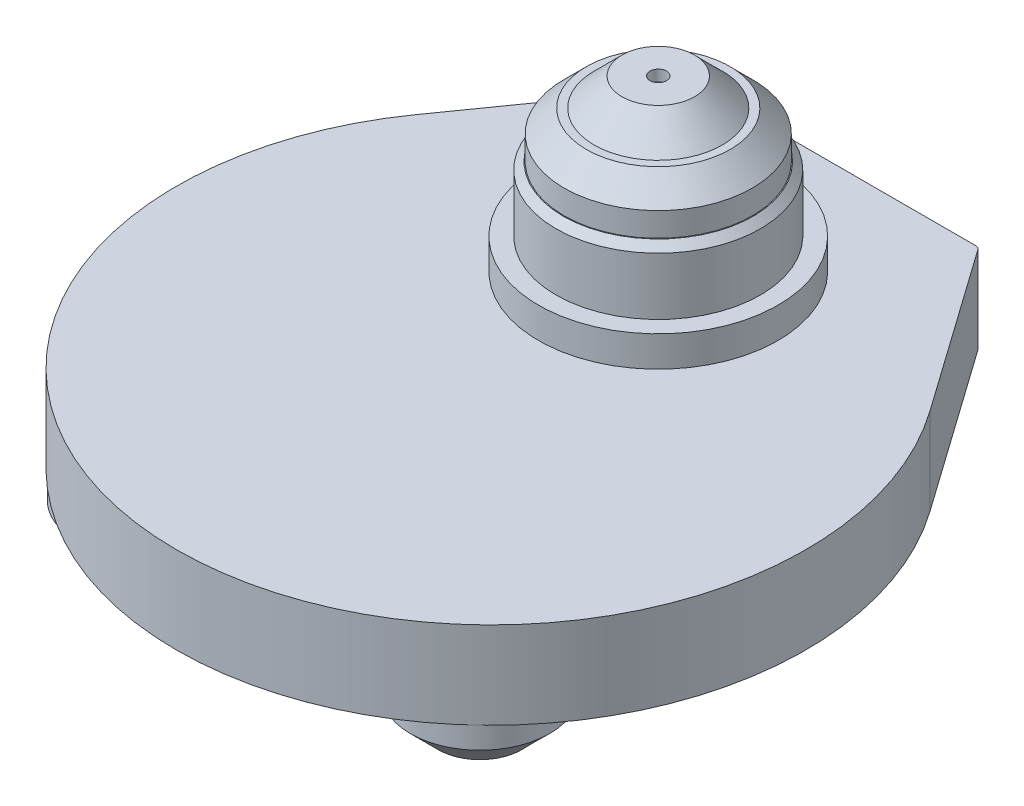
ISO-10303-21;
HEADER;
FILE_DESCRIPTION(('STEP AP214'),'2;1');
FILE_NAME('part.step','',(''),(''),'','','');
FILE_SCHEMA(('AUTOMOTIVE_DESIGN { 1 0 10303 214 1 1 1 1 }'));
ENDSEC;
DATA;
#1=APPLICATION_CONTEXT('core data for automotive mechanical design processes');
#2=APPLICATION_PROTOCOL_DEFINITION('international standard','automotive_design',2000,#1);
#3=PRODUCT_CONTEXT('',#1,'mechanical');
#4=PRODUCT('Part','Part','',(#3));
#5=PRODUCT_RELATED_PRODUCT_CATEGORY('part','',(#4));
#6=PRODUCT_DEFINITION_FORMATION('','',#4);
#7=PRODUCT_DEFINITION_CONTEXT('part definition',#1,'design');
#8=PRODUCT_DEFINITION('design','',#6,#7);
#9=PRODUCT_DEFINITION_SHAPE('','',#8);
#10=(LENGTH_UNIT() NAMED_UNIT(*) SI_UNIT(.MILLI.,.METRE.));
#11=(NAMED_UNIT(*) PLANE_ANGLE_UNIT() SI_UNIT($,.RADIAN.));
#12=(NAMED_UNIT(*) SI_UNIT($,.STERADIAN.) SOLID_ANGLE_UNIT());
#13=UNCERTAINTY_MEASURE_WITH_UNIT(LENGTH_MEASURE(1.E-05),#10,'distance_accuracy_value','');
#14=(GEOMETRIC_REPRESENTATION_CONTEXT(3) GLOBAL_UNCERTAINTY_ASSIGNED_CONTEXT((#13)) GLOBAL_UNIT_ASSIGNED_CONTEXT((#10,
#11,#12)) REPRESENTATION_CONTEXT('',''));
#15=CARTESIAN_POINT('',(0.,0.,0.));
#16=DIRECTION('',(0.,0.,1.));
#17=DIRECTION('',(1.,0.,0.));
#18=AXIS2_PLACEMENT_3D('',#15,#16,#17);
#19=CARTESIAN_POINT('',(0.,0.,30.));
#20=DIRECTION('',(0.,1.,0.));
#21=DIRECTION('',(0.,0.,1.));
#22=AXIS2_PLACEMENT_3D('',#19,#20,#21);
#23=PLANE('',#22);
#24=CARTESIAN_POINT('',(30.,0.,62.));
#25=DIRECTION('',(0.,1.,0.));
#26=DIRECTION('',(0.,0.,1.));
#27=AXIS2_PLACEMENT_3D('',#24,#25,#26);
#28=CIRCLE('',#27,12.5);
#29=CARTESIAN_POINT('',(30.,0.,74.5));
#30=VERTEX_POINT('',#29);
#31=EDGE_CURVE('E324',#30,#30,#28,.F.);
#32=ORIENTED_EDGE('',*,*,#31,.F.);
#33=EDGE_LOOP('',(#32));
#34=FACE_BOUND('',#33,.T.);
#35=DIRECTION('',(-1.,0.,0.));
#36=VECTOR('',#35,1.);
#37=CARTESIAN_POINT('',(-25.,0.,-32.5));
#38=LINE('',#37,#36);
#39=CARTESIAN_POINT('',(24.482417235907,0.,-32.5));
#40=VERTEX_POINT('',#39);
#41=CARTESIAN_POINT('',(-24.482417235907,0.,-32.5));
#42=VERTEX_POINT('',#41);
#43=EDGE_CURVE('E358',#40,#42,#38,.T.);
#44=ORIENTED_EDGE('',*,*,#43,.F.);
#45=CARTESIAN_POINT('',(24.482417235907,0.,-31.5));
#46=DIRECTION('',(0.,1.,0.));
#47=DIRECTION('',(0.,0.,1.));
#48=AXIS2_PLACEMENT_3D('',#45,#46,#47);
#49=CIRCLE('',#48,1.);
#50=CARTESIAN_POINT('',(25.2988634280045,0.,-32.077421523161));
#51=VERTEX_POINT('',#50);
#52=EDGE_CURVE('E476',#40,#51,#49,.F.);
#53=ORIENTED_EDGE('',*,*,#52,.T.);
#54=DIRECTION('',(-0.577421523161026,0.,-0.816446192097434));
#55=VECTOR('',#54,1.);
#56=CARTESIAN_POINT('',(25.,0.,-32.5));
#57=LINE('',#56,#55);
#58=CARTESIAN_POINT('',(46.129209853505,0.,-2.62431605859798));
#59=VERTEX_POINT('',#58);
#60=EDGE_CURVE('E362',#59,#51,#57,.T.);
#61=ORIENTED_EDGE('',*,*,#60,.F.);
#62=CARTESIAN_POINT('',(0.,0.,30.));
#63=DIRECTION('',(0.,1.,0.));
#64=DIRECTION('',(0.,0.,1.));
#65=AXIS2_PLACEMENT_3D('',#62,#63,#64);
#66=CIRCLE('',#65,56.5);
#67=CARTESIAN_POINT('',(-46.129209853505,0.,-2.62431605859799));
#68=VERTEX_POINT('',#67);
#69=EDGE_CURVE('E365',#68,#59,#66,.T.);
#70=ORIENTED_EDGE('',*,*,#69,.F.);
#71=DIRECTION('',(-0.577421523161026,0.,0.816446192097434));
#72=VECTOR('',#71,1.);
#73=CARTESIAN_POINT('',(-25.,0.,-32.5));
#74=LINE('',#73,#72);
#75=CARTESIAN_POINT('',(-25.2988634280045,0.,-32.077421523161));
#76=VERTEX_POINT('',#75);
#77=EDGE_CURVE('E367',#76,#68,#74,.T.);
#78=ORIENTED_EDGE('',*,*,#77,.F.);
#79=CARTESIAN_POINT('',(-24.482417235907,0.,-31.5));
#80=DIRECTION('',(0.,1.,0.));
#81=DIRECTION('',(0.,0.,1.));
#82=AXIS2_PLACEMENT_3D('',#79,#80,#81);
#83=CIRCLE('',#82,1.);
#84=EDGE_CURVE('E474',#76,#42,#83,.F.);
#85=ORIENTED_EDGE('',*,*,#84,.T.);
#86=EDGE_LOOP('',(#44,#53,#61,#70,#78,#85));
#87=FACE_BOUND('',#86,.T.);
#88=DIRECTION('',(0.,0.,1.));
#89=VECTOR('',#88,1.);
#90=CARTESIAN_POINT('',(8.,0.,-31.5));
#91=LINE('',#90,#89);
#92=CARTESIAN_POINT('',(8.,0.,-30.5));
#93=VERTEX_POINT('',#92);
#94=CARTESIAN_POINT('',(8.,0.,-24.0018749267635));
#95=VERTEX_POINT('',#94);
#96=EDGE_CURVE('E400',#93,#95,#91,.T.);
#97=ORIENTED_EDGE('',*,*,#96,.F.);
#98=CARTESIAN_POINT('',(7.,0.,-30.5));
#99=DIRECTION('',(0.,1.,0.));
#100=DIRECTION('',(0.,0.,1.));
#101=AXIS2_PLACEMENT_3D('',#98,#99,#100);
#102=CIRCLE('',#101,1.);
#103=CARTESIAN_POINT('',(7.,0.,-31.5));
#104=VERTEX_POINT('',#103);
#105=EDGE_CURVE('E45',#93,#104,#102,.T.);
#106=ORIENTED_EDGE('',*,*,#105,.T.);
#107=DIRECTION('',(1.,0.,0.));
#108=VECTOR('',#107,1.);
#109=CARTESIAN_POINT('',(0.,0.,-31.5));
#110=LINE('',#109,#108);
#111=CARTESIAN_POINT('',(-7.,0.,-31.5));
#112=VERTEX_POINT('',#111);
#113=EDGE_CURVE('E402',#112,#104,#110,.T.);
#114=ORIENTED_EDGE('',*,*,#113,.F.);
#115=CARTESIAN_POINT('',(-7.,0.,-30.5));
#116=DIRECTION('',(0.,1.,0.));
#117=DIRECTION('',(0.,0.,1.));
#118=AXIS2_PLACEMENT_3D('',#115,#116,#117);
#119=CIRCLE('',#118,1.);
#120=CARTESIAN_POINT('',(-8.,0.,-30.5));
#121=VERTEX_POINT('',#120);
#122=EDGE_CURVE('E13',#112,#121,#119,.T.);
#123=ORIENTED_EDGE('',*,*,#122,.T.);
#124=DIRECTION('',(0.,0.,-1.));
#125=VECTOR('',#124,1.);
#126=CARTESIAN_POINT('',(-8.,0.,-31.5));
#127=LINE('',#126,#125);
#128=CARTESIAN_POINT('',(-8.,0.,-24.0018749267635));
#129=VERTEX_POINT('',#128);
#130=EDGE_CURVE('E397',#129,#121,#127,.T.);
#131=ORIENTED_EDGE('',*,*,#130,.F.);
#132=CARTESIAN_POINT('',(0.,0.,0.));
#133=DIRECTION('',(0.,1.,0.));
#134=DIRECTION('',(0.,0.,1.));
#135=AXIS2_PLACEMENT_3D('',#132,#133,#134);
#136=CIRCLE('',#135,25.3);
#137=EDGE_CURVE('E325',#95,#129,#136,.F.);
#138=ORIENTED_EDGE('',*,*,#137,.F.);
#139=EDGE_LOOP('',(#97,#106,#114,#123,#131,#138));
#140=FACE_BOUND('',#139,.T.);
#141=CARTESIAN_POINT('',(-30.,0.,62.));
#142=DIRECTION('',(0.,1.,0.));
#143=DIRECTION('',(0.,0.,1.));
#144=AXIS2_PLACEMENT_3D('',#141,#142,#143);
#145=CIRCLE('',#144,12.5);
#146=CARTESIAN_POINT('',(-30.,0.,74.5));
#147=VERTEX_POINT('',#146);
#148=EDGE_CURVE('E316',#147,#147,#145,.F.);
#149=ORIENTED_EDGE('',*,*,#148,.F.);
#150=EDGE_LOOP('',(#149));
#151=FACE_BOUND('',#150,.T.);
#152=ADVANCED_FACE('F37',(#34,#87,#140,#151),#23,.F.);
#153=CARTESIAN_POINT('',(0.,-8.9,0.));
#154=DIRECTION('',(0.,-1.,0.));
#155=DIRECTION('',(0.,0.,-1.));
#156=AXIS2_PLACEMENT_3D('',#153,#154,#155);
#157=PLANE('',#156);
#158=CARTESIAN_POINT('',(0.,-8.9,0.));
#159=DIRECTION('',(0.,-1.,0.));
#160=DIRECTION('',(0.,0.,-1.));
#161=AXIS2_PLACEMENT_3D('',#158,#159,#160);
#162=CIRCLE('',#161,25.3);
#163=CARTESIAN_POINT('',(0.,-8.9,-25.3));
#164=VERTEX_POINT('',#163);
#165=EDGE_CURVE('E387',#164,#164,#162,.T.);
#166=ORIENTED_EDGE('',*,*,#165,.T.);
#167=EDGE_LOOP('',(#166));
#168=FACE_BOUND('',#167,.T.);
#169=CARTESIAN_POINT('',(0.,-8.9,0.));
#170=DIRECTION('',(0.,-1.,0.));
#171=DIRECTION('',(0.,0.,-1.));
#172=AXIS2_PLACEMENT_3D('',#169,#170,#171);
#173=CIRCLE('',#172,18.1175227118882);
#174=CARTESIAN_POINT('',(0.,-8.9,-18.1175227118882));
#175=VERTEX_POINT('',#174);
#176=EDGE_CURVE('E404',#175,#175,#173,.T.);
#177=ORIENTED_EDGE('',*,*,#176,.F.);
#178=EDGE_LOOP('',(#177));
#179=FACE_BOUND('',#178,.T.);
#180=ADVANCED_FACE('F235',(#168,#179),#157,.T.);
#181=CARTESIAN_POINT('',(0.,-8.9,0.));
#182=DIRECTION('',(0.,1.,0.));
#183=DIRECTION('',(0.,0.,1.));
#184=AXIS2_PLACEMENT_3D('',#181,#182,#183);
#185=CYLINDRICAL_SURFACE('',#184,25.3);
#186=ORIENTED_EDGE('',*,*,#165,.F.);
#187=EDGE_LOOP('',(#186));
#188=FACE_BOUND('',#187,.T.);
#189=DIRECTION('',(0.,1.,0.));
#190=VECTOR('',#189,1.);
#191=CARTESIAN_POINT('',(8.,-8.7,-24.0018749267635));
#192=LINE('',#191,#190);
#193=CARTESIAN_POINT('',(8.,-8.7,-24.0018749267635));
#194=VERTEX_POINT('',#193);
#195=EDGE_CURVE('E390',#194,#95,#192,.T.);
#196=ORIENTED_EDGE('',*,*,#195,.T.);
#197=ORIENTED_EDGE('',*,*,#137,.T.);
#198=DIRECTION('',(0.,1.,0.));
#199=VECTOR('',#198,1.);
#200=CARTESIAN_POINT('',(-7.99999999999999,-8.7,-24.0018749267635));
#201=LINE('',#200,#199);
#202=CARTESIAN_POINT('',(-7.99999999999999,-8.7,-24.0018749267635));
#203=VERTEX_POINT('',#202);
#204=EDGE_CURVE('E393',#203,#129,#201,.T.);
#205=ORIENTED_EDGE('',*,*,#204,.F.);
#206=CARTESIAN_POINT('',(0.,-8.7,0.));
#207=DIRECTION('',(0.,1.,0.));
#208=DIRECTION('',(0.,0.,1.));
#209=AXIS2_PLACEMENT_3D('',#206,#207,#208);
#210=CIRCLE('',#209,25.3);
#211=EDGE_CURVE('E406',#194,#203,#210,.T.);
#212=ORIENTED_EDGE('',*,*,#211,.F.);
#213=EDGE_LOOP('',(#196,#197,#205,#212));
#214=FACE_BOUND('',#213,.T.);
#215=ADVANCED_FACE('F238',(#188,#214),#185,.T.);
#216=CARTESIAN_POINT('',(0.,32.7,0.));
#217=DIRECTION('',(0.,1.,0.));
#218=DIRECTION('',(0.,0.,1.));
#219=AXIS2_PLACEMENT_3D('',#216,#217,#218);
#220=CYLINDRICAL_SURFACE('',#219,16.9);
#221=CARTESIAN_POINT('',(0.,37.,0.));
#222=DIRECTION('',(0.,1.,0.));
#223=DIRECTION('',(0.,0.,1.));
#224=AXIS2_PLACEMENT_3D('',#221,#222,#223);
#225=CIRCLE('',#224,16.9);
#226=CARTESIAN_POINT('',(0.,37.,16.9));
#227=VERTEX_POINT('',#226);
#228=EDGE_CURVE('E337',#227,#227,#225,.F.);
#229=ORIENTED_EDGE('',*,*,#228,.T.);
#230=EDGE_LOOP('',(#229));
#231=FACE_BOUND('',#230,.T.);
#232=CARTESIAN_POINT('',(0.,32.7,0.));
#233=DIRECTION('',(0.,1.,0.));
#234=DIRECTION('',(0.,0.,1.));
#235=AXIS2_PLACEMENT_3D('',#232,#233,#234);
#236=CIRCLE('',#235,16.9);
#237=CARTESIAN_POINT('',(0.,32.7,16.9));
#238=VERTEX_POINT('',#237);
#239=EDGE_CURVE('E381',#238,#238,#236,.T.);
#240=ORIENTED_EDGE('',*,*,#239,.T.);
#241=EDGE_LOOP('',(#240));
#242=FACE_BOUND('',#241,.T.);
#243=ADVANCED_FACE('F242',(#231,#242),#220,.T.);
#244=CARTESIAN_POINT('',(0.,21.1,0.));
#245=DIRECTION('',(0.,1.,0.));
#246=DIRECTION('',(0.,0.,1.));
#247=AXIS2_PLACEMENT_3D('',#244,#245,#246);
#248=CYLINDRICAL_SURFACE('',#247,18.35);
#249=CARTESIAN_POINT('',(0.,31.4,0.));
#250=DIRECTION('',(0.,1.,0.));
#251=DIRECTION('',(0.,0.,1.));
#252=AXIS2_PLACEMENT_3D('',#249,#250,#251);
#253=CIRCLE('',#252,18.35);
#254=CARTESIAN_POINT('',(0.,31.4,18.35));
#255=VERTEX_POINT('',#254);
#256=EDGE_CURVE('E343',#255,#255,#253,.F.);
#257=ORIENTED_EDGE('',*,*,#256,.T.);
#258=EDGE_LOOP('',(#257));
#259=FACE_BOUND('',#258,.T.);
#260=CARTESIAN_POINT('',(0.,21.1,0.));
#261=DIRECTION('',(0.,1.,0.));
#262=DIRECTION('',(0.,0.,1.));
#263=AXIS2_PLACEMENT_3D('',#260,#261,#262);
#264=CIRCLE('',#263,18.35);
#265=CARTESIAN_POINT('',(0.,21.1,18.35));
#266=VERTEX_POINT('',#265);
#267=EDGE_CURVE('E351',#266,#266,#264,.T.);
#268=ORIENTED_EDGE('',*,*,#267,.T.);
#269=EDGE_LOOP('',(#268));
#270=FACE_BOUND('',#269,.T.);
#271=ADVANCED_FACE('F252',(#259,#270),#248,.T.);
#272=CARTESIAN_POINT('',(0.,46.,0.));
#273=DIRECTION('',(0.,-1.,0.));
#274=DIRECTION('',(0.,0.,-1.));
#275=AXIS2_PLACEMENT_3D('',#272,#273,#274);
#276=CYLINDRICAL_SURFACE('',#275,21.5);
#277=CARTESIAN_POINT('',(0.,15.6,0.));
#278=DIRECTION('',(0.,1.,0.));
#279=DIRECTION('',(0.,0.,1.));
#280=AXIS2_PLACEMENT_3D('',#277,#278,#279);
#281=CIRCLE('',#280,21.5);
#282=CARTESIAN_POINT('',(0.,15.6,-21.5));
#283=VERTEX_POINT('',#282);
#284=EDGE_CURVE('E350',#283,#283,#281,.T.);
#285=CARTESIAN_POINT('',(0.,21.1,0.));
#286=DIRECTION('',(0.,1.,0.));
#287=DIRECTION('',(0.,0.,1.));
#288=AXIS2_PLACEMENT_3D('',#285,#286,#287);
#289=CIRCLE('',#288,21.5);
#290=CARTESIAN_POINT('',(0.,21.1,-21.5));
#291=VERTEX_POINT('',#290);
#292=EDGE_CURVE('E347',#291,#291,#289,.T.);
#293=CARTESIAN_POINT('',(0.,15.6,-21.5));
#294=CARTESIAN_POINT('',(0.,15.6572916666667,-21.5));
#295=CARTESIAN_POINT('',(0.,15.7145833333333,-21.5));
#296=CARTESIAN_POINT('',(0.,15.8291666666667,-21.5));
#297=CARTESIAN_POINT('',(0.,15.8864583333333,-21.5));
#298=CARTESIAN_POINT('',(0.,16.0010416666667,-21.5));
#299=CARTESIAN_POINT('',(0.,16.0583333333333,-21.5));
#300=CARTESIAN_POINT('',(0.,16.1729166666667,-21.5));
#301=CARTESIAN_POINT('',(0.,16.2302083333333,-21.5));
#302=CARTESIAN_POINT('',(0.,16.3447916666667,-21.5));
#303=CARTESIAN_POINT('',(0.,16.4020833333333,-21.5));
#304=CARTESIAN_POINT('',(0.,16.5166666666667,-21.5));
#305=CARTESIAN_POINT('',(0.,16.5739583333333,-21.5));
#306=CARTESIAN_POINT('',(0.,16.6885416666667,-21.5));
#307=CARTESIAN_POINT('',(0.,16.7458333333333,-21.5));
#308=CARTESIAN_POINT('',(0.,16.8604166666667,-21.5));
#309=CARTESIAN_POINT('',(0.,16.9177083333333,-21.5));
#310=CARTESIAN_POINT('',(0.,17.0322916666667,-21.5));
#311=CARTESIAN_POINT('',(0.,17.0895833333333,-21.5));
#312=CARTESIAN_POINT('',(0.,17.2041666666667,-21.5));
#313=CARTESIAN_POINT('',(0.,17.2614583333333,-21.5));
#314=CARTESIAN_POINT('',(0.,17.3760416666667,-21.5));
#315=CARTESIAN_POINT('',(0.,17.4333333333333,-21.5));
#316=CARTESIAN_POINT('',(0.,17.5479166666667,-21.5));
#317=CARTESIAN_POINT('',(0.,17.6052083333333,-21.5));
#318=CARTESIAN_POINT('',(0.,17.7197916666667,-21.5));
#319=CARTESIAN_POINT('',(0.,17.7770833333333,-21.5));
#320=CARTESIAN_POINT('',(0.,17.8916666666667,-21.5));
#321=CARTESIAN_POINT('',(0.,17.9489583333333,-21.5));
#322=CARTESIAN_POINT('',(0.,18.0635416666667,-21.5));
#323=CARTESIAN_POINT('',(0.,18.1208333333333,-21.5));
#324=CARTESIAN_POINT('',(0.,18.2354166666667,-21.5));
#325=CARTESIAN_POINT('',(0.,18.2927083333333,-21.5));
#326=CARTESIAN_POINT('',(0.,18.4072916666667,-21.5));
#327=CARTESIAN_POINT('',(0.,18.4645833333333,-21.5));
#328=CARTESIAN_POINT('',(0.,18.5791666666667,-21.5));
#329=CARTESIAN_POINT('',(0.,18.6364583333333,-21.5));
#330=CARTESIAN_POINT('',(0.,18.7510416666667,-21.5));
#331=CARTESIAN_POINT('',(0.,18.8083333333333,-21.5));
#332=CARTESIAN_POINT('',(0.,18.9229166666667,-21.5));
#333=CARTESIAN_POINT('',(0.,18.9802083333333,-21.5));
#334=CARTESIAN_POINT('',(0.,19.0947916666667,-21.5));
#335=CARTESIAN_POINT('',(0.,19.1520833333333,-21.5));
#336=CARTESIAN_POINT('',(0.,19.2666666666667,-21.5));
#337=CARTESIAN_POINT('',(0.,19.3239583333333,-21.5));
#338=CARTESIAN_POINT('',(0.,19.4385416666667,-21.5));
#339=CARTESIAN_POINT('',(0.,19.4958333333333,-21.5));
#340=CARTESIAN_POINT('',(0.,19.6104166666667,-21.5));
#341=CARTESIAN_POINT('',(0.,19.6677083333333,-21.5));
#342=CARTESIAN_POINT('',(0.,19.7822916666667,-21.5));
#343=CARTESIAN_POINT('',(0.,19.8395833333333,-21.5));
#344=CARTESIAN_POINT('',(0.,19.9541666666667,-21.5));
#345=CARTESIAN_POINT('',(0.,20.0114583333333,-21.5));
#346=CARTESIAN_POINT('',(0.,20.1260416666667,-21.5));
#347=CARTESIAN_POINT('',(0.,20.1833333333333,-21.5));
#348=CARTESIAN_POINT('',(0.,20.2979166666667,-21.5));
#349=CARTESIAN_POINT('',(0.,20.3552083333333,-21.5));
#350=CARTESIAN_POINT('',(0.,20.4697916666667,-21.5));
#351=CARTESIAN_POINT('',(0.,20.5270833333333,-21.5));
#352=CARTESIAN_POINT('',(0.,20.6416666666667,-21.5));
#353=CARTESIAN_POINT('',(0.,20.6989583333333,-21.5));
#354=CARTESIAN_POINT('',(0.,20.8135416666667,-21.5));
#355=CARTESIAN_POINT('',(0.,20.8708333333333,-21.5));
#356=CARTESIAN_POINT('',(0.,20.9854166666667,-21.5));
#357=CARTESIAN_POINT('',(0.,21.0427083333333,-21.5));
#358=CARTESIAN_POINT('',(0.,21.1,-21.5));
#359=B_SPLINE_CURVE_WITH_KNOTS('',3,(#293,#294,#295,#296,#297,#298,#299,#300,#301,#302,#303,
#304,#305,#306,#307,#308,#309,#310,#311,#312,#313,#314,#315,#316,#317,#318,#319,#320,#321,#322,
#323,#324,#325,#326,#327,#328,#329,#330,#331,#332,#333,#334,#335,#336,#337,#338,#339,#340,#341,
#342,#343,#344,#345,#346,#347,#348,#349,#350,#351,#352,#353,#354,#355,#356,#357,#358),
.UNSPECIFIED.,.F.,.F.,(4,2,2,2,2,2,2,2,2,2,2,2,2,2,2,2,2,2,2,2,2,2,2,2,2,2,2,2,2,2,2,2,4),(0.,
0.171874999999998,0.34375,0.515624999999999,0.687500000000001,0.859374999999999,1.03125,
1.203125,1.375,1.546875,1.71875,1.890625,2.0625,2.234375,2.40625,2.578125,2.75,2.921875,3.09375,
3.265625,3.4375,3.609375,3.78125,3.953125,4.125,4.296875,4.46875,4.640625,4.8125,4.984375,
5.15625,5.328125,5.5),.UNSPECIFIED.);
#360=EDGE_CURVE('BSEAM260',#283,#291,#359,.T.);
#361=ORIENTED_EDGE('',*,*,#284,.T.);
#362=ORIENTED_EDGE('',*,*,#292,.F.);
#363=ORIENTED_EDGE('',*,*,#360,.T.);
#364=ORIENTED_EDGE('',*,*,#360,.F.);
#365=EDGE_LOOP('',(#361,#363,#362,#364));
#366=FACE_BOUND('',#365,.T.);
#367=ADVANCED_FACE('F260',(#366),#276,.T.);
#368=CARTESIAN_POINT('',(0.,15.6,30.));
#369=DIRECTION('',(0.,1.,0.));
#370=DIRECTION('',(0.,0.,1.));
#371=AXIS2_PLACEMENT_3D('',#368,#369,#370);
#372=PLANE('',#371);
#373=DIRECTION('',(-0.577421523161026,0.,-0.816446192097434));
#374=VECTOR('',#373,1.);
#375=CARTESIAN_POINT('',(25.,15.6,-32.5));
#376=LINE('',#375,#374);
#377=CARTESIAN_POINT('',(46.129209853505,15.6,-2.62431605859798));
#378=VERTEX_POINT('',#377);
#379=CARTESIAN_POINT('',(25.2988634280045,15.6,-32.077421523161));
#380=VERTEX_POINT('',#379);
#381=EDGE_CURVE('E371',#378,#380,#376,.T.);
#382=ORIENTED_EDGE('',*,*,#381,.T.);
#383=CARTESIAN_POINT('',(24.482417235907,15.6,-31.5));
#384=DIRECTION('',(0.,1.,0.));
#385=DIRECTION('',(0.,0.,1.));
#386=AXIS2_PLACEMENT_3D('',#383,#384,#385);
#387=CIRCLE('',#386,1.);
#388=CARTESIAN_POINT('',(24.482417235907,15.6,-32.5));
#389=VERTEX_POINT('',#388);
#390=EDGE_CURVE('E482',#380,#389,#387,.T.);
#391=ORIENTED_EDGE('',*,*,#390,.T.);
#392=DIRECTION('',(-1.,0.,0.));
#393=VECTOR('',#392,1.);
#394=CARTESIAN_POINT('',(0.,15.6,-32.5));
#395=LINE('',#394,#393);
#396=CARTESIAN_POINT('',(-24.482417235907,15.6,-32.5));
#397=VERTEX_POINT('',#396);
#398=EDGE_CURVE('E357',#389,#397,#395,.T.);
#399=ORIENTED_EDGE('',*,*,#398,.T.);
#400=CARTESIAN_POINT('',(-24.482417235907,15.6,-31.5));
#401=DIRECTION('',(0.,1.,0.));
#402=DIRECTION('',(0.,0.,1.));
#403=AXIS2_PLACEMENT_3D('',#400,#401,#402);
#404=CIRCLE('',#403,1.);
#405=CARTESIAN_POINT('',(-25.2988634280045,15.6,-32.077421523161));
#406=VERTEX_POINT('',#405);
#407=EDGE_CURVE('E480',#397,#406,#404,.T.);
#408=ORIENTED_EDGE('',*,*,#407,.T.);
#409=DIRECTION('',(-0.577421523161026,0.,0.816446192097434));
#410=VECTOR('',#409,1.);
#411=CARTESIAN_POINT('',(-25.,15.6,-32.5));
#412=LINE('',#411,#410);
#413=CARTESIAN_POINT('',(-46.129209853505,15.6,-2.62431605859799));
#414=VERTEX_POINT('',#413);
#415=EDGE_CURVE('E361',#406,#414,#412,.T.);
#416=ORIENTED_EDGE('',*,*,#415,.T.);
#417=CARTESIAN_POINT('',(0.,15.6,30.));
#418=DIRECTION('',(0.,1.,0.));
#419=DIRECTION('',(0.,0.,1.));
#420=AXIS2_PLACEMENT_3D('',#417,#418,#419);
#421=CIRCLE('',#420,56.5);
#422=EDGE_CURVE('E374',#414,#378,#421,.T.);
#423=ORIENTED_EDGE('',*,*,#422,.T.);
#424=EDGE_LOOP('',(#382,#391,#399,#408,#416,#423));
#425=FACE_BOUND('',#424,.T.);
#426=ORIENTED_EDGE('',*,*,#284,.F.);
#427=EDGE_LOOP('',(#426));
#428=FACE_BOUND('',#427,.T.);
#429=ADVANCED_FACE('F272',(#425,#428),#372,.T.);
#430=CARTESIAN_POINT('',(-25.,15.6,-32.5));
#431=DIRECTION('',(0.816446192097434,0.,0.577421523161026));
#432=DIRECTION('',(0.577421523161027,0.,-0.816446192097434));
#433=AXIS2_PLACEMENT_3D('',#430,#431,#432);
#434=PLANE('',#433);
#435=ORIENTED_EDGE('',*,*,#415,.F.);
#436=DIRECTION('',(0.,-1.,0.));
#437=VECTOR('',#436,1.);
#438=CARTESIAN_POINT('',(-25.2988634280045,15.6,-32.077421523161));
#439=LINE('',#438,#437);
#440=EDGE_CURVE('E496',#406,#76,#439,.T.);
#441=ORIENTED_EDGE('',*,*,#440,.T.);
#442=ORIENTED_EDGE('',*,*,#77,.T.);
#443=DIRECTION('',(0.,-1.,0.));
#444=VECTOR('',#443,1.);
#445=CARTESIAN_POINT('',(-46.129209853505,15.6,-2.62431605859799));
#446=LINE('',#445,#444);
#447=EDGE_CURVE('E346',#414,#68,#446,.T.);
#448=ORIENTED_EDGE('',*,*,#447,.F.);
#449=EDGE_LOOP('',(#435,#441,#442,#448));
#450=FACE_BOUND('',#449,.T.);
#451=ADVANCED_FACE('F276',(#450),#434,.F.);
#452=CARTESIAN_POINT('',(0.,15.6,30.));
#453=DIRECTION('',(0.,-1.,0.));
#454=DIRECTION('',(0.,0.,-1.));
#455=AXIS2_PLACEMENT_3D('',#452,#453,#454);
#456=CYLINDRICAL_SURFACE('',#455,56.5);
#457=ORIENTED_EDGE('',*,*,#69,.T.);
#458=DIRECTION('',(0.,-1.,0.));
#459=VECTOR('',#458,1.);
#460=CARTESIAN_POINT('',(46.129209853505,15.6,-2.62431605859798));
#461=LINE('',#460,#459);
#462=EDGE_CURVE('E354',#378,#59,#461,.T.);
#463=ORIENTED_EDGE('',*,*,#462,.F.);
#464=ORIENTED_EDGE('',*,*,#422,.F.);
#465=ORIENTED_EDGE('',*,*,#447,.T.);
#466=EDGE_LOOP('',(#457,#463,#464,#465));
#467=FACE_BOUND('',#466,.T.);
#468=ADVANCED_FACE('F287',(#467),#456,.T.);
#469=CARTESIAN_POINT('',(25.,15.6,-32.5));
#470=DIRECTION('',(-0.816446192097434,0.,0.577421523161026));
#471=DIRECTION('',(0.577421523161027,0.,0.816446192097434));
#472=AXIS2_PLACEMENT_3D('',#469,#470,#471);
#473=PLANE('',#472);
#474=ORIENTED_EDGE('',*,*,#60,.T.);
#475=DIRECTION('',(0.,-1.,0.));
#476=VECTOR('',#475,1.);
#477=CARTESIAN_POINT('',(25.2988634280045,15.6,-32.077421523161));
#478=LINE('',#477,#476);
#479=EDGE_CURVE('E478',#51,#380,#478,.F.);
#480=ORIENTED_EDGE('',*,*,#479,.T.);
#481=ORIENTED_EDGE('',*,*,#381,.F.);
#482=ORIENTED_EDGE('',*,*,#462,.T.);
#483=EDGE_LOOP('',(#474,#480,#481,#482));
#484=FACE_BOUND('',#483,.T.);
#485=ADVANCED_FACE('F283',(#484),#473,.F.);
#486=CARTESIAN_POINT('',(-25.,15.6,-32.5));
#487=DIRECTION('',(0.,0.,1.));
#488=DIRECTION('',(1.,0.,0.));
#489=AXIS2_PLACEMENT_3D('',#486,#487,#488);
#490=PLANE('',#489);
#491=ORIENTED_EDGE('',*,*,#398,.F.);
#492=DIRECTION('',(0.,-1.,0.));
#493=VECTOR('',#492,1.);
#494=CARTESIAN_POINT('',(24.482417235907,15.6,-32.5));
#495=LINE('',#494,#493);
#496=EDGE_CURVE('E471',#389,#40,#495,.T.);
#497=ORIENTED_EDGE('',*,*,#496,.T.);
#498=ORIENTED_EDGE('',*,*,#43,.T.);
#499=DIRECTION('',(0.,-1.,0.));
#500=VECTOR('',#499,1.);
#501=CARTESIAN_POINT('',(-24.482417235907,15.6,-32.5));
#502=LINE('',#501,#500);
#503=EDGE_CURVE('E469',#42,#397,#502,.F.);
#504=ORIENTED_EDGE('',*,*,#503,.T.);
#505=EDGE_LOOP('',(#491,#497,#498,#504));
#506=FACE_BOUND('',#505,.T.);
#507=ADVANCED_FACE('F264',(#506),#490,.F.);
#508=CARTESIAN_POINT('',(0.,21.1,27.));
#509=DIRECTION('',(0.,1.,0.));
#510=DIRECTION('',(0.,0.,1.));
#511=AXIS2_PLACEMENT_3D('',#508,#509,#510);
#512=PLANE('',#511);
#513=ORIENTED_EDGE('',*,*,#267,.F.);
#514=EDGE_LOOP('',(#513));
#515=FACE_BOUND('',#514,.T.);
#516=ORIENTED_EDGE('',*,*,#292,.T.);
#517=EDGE_LOOP('',(#516));
#518=FACE_BOUND('',#517,.T.);
#519=ADVANCED_FACE('F256',(#515,#518),#512,.T.);
#520=CARTESIAN_POINT('',(0.,32.7,27.));
#521=DIRECTION('',(0.,1.,0.));
#522=DIRECTION('',(0.,0.,1.));
#523=AXIS2_PLACEMENT_3D('',#520,#521,#522);
#524=PLANE('',#523);
#525=CARTESIAN_POINT('',(0.,32.7,0.));
#526=DIRECTION('',(0.,1.,0.));
#527=DIRECTION('',(0.,0.,1.));
#528=AXIS2_PLACEMENT_3D('',#525,#526,#527);
#529=CIRCLE('',#528,17.05);
#530=CARTESIAN_POINT('',(0.,32.7,17.05));
#531=VERTEX_POINT('',#530);
#532=EDGE_CURVE('E340',#531,#531,#529,.T.);
#533=ORIENTED_EDGE('',*,*,#532,.T.);
#534=EDGE_LOOP('',(#533));
#535=FACE_BOUND('',#534,.T.);
#536=ORIENTED_EDGE('',*,*,#239,.F.);
#537=EDGE_LOOP('',(#536));
#538=FACE_BOUND('',#537,.T.);
#539=ADVANCED_FACE('F248',(#535,#538),#524,.T.);
#540=CARTESIAN_POINT('',(0.,41.,27.));
#541=DIRECTION('',(0.,1.,0.));
#542=DIRECTION('',(0.,0.,1.));
#543=AXIS2_PLACEMENT_3D('',#540,#541,#542);
#544=PLANE('',#543);
#545=CARTESIAN_POINT('',(0.,41.,0.));
#546=DIRECTION('',(0.,1.,0.));
#547=DIRECTION('',(0.,0.,1.));
#548=AXIS2_PLACEMENT_3D('',#545,#546,#547);
#549=CIRCLE('',#548,12.9);
#550=CARTESIAN_POINT('',(0.,41.,12.9));
#551=VERTEX_POINT('',#550);
#552=EDGE_CURVE('E334',#551,#551,#549,.T.);
#553=ORIENTED_EDGE('',*,*,#552,.T.);
#554=EDGE_LOOP('',(#553));
#555=FACE_BOUND('',#554,.T.);
#556=CARTESIAN_POINT('',(0.,41.,0.));
#557=DIRECTION('',(0.,1.,0.));
#558=DIRECTION('',(0.,0.,1.));
#559=AXIS2_PLACEMENT_3D('',#556,#557,#558);
#560=CIRCLE('',#559,11.5);
#561=CARTESIAN_POINT('',(0.,41.,11.5));
#562=VERTEX_POINT('',#561);
#563=EDGE_CURVE('E384',#562,#562,#560,.T.);
#564=ORIENTED_EDGE('',*,*,#563,.F.);
#565=EDGE_LOOP('',(#564));
#566=FACE_BOUND('',#565,.T.);
#567=ADVANCED_FACE('F244',(#555,#566),#544,.T.);
#568=CARTESIAN_POINT('',(0.,46.,0.));
#569=DIRECTION('',(0.,1.,0.));
#570=DIRECTION('',(0.,0.,1.));
#571=AXIS2_PLACEMENT_3D('',#568,#569,#570);
#572=PLANE('',#571);
#573=CARTESIAN_POINT('',(0.,46.,0.));
#574=DIRECTION('',(0.,1.,0.));
#575=DIRECTION('',(0.,0.,1.));
#576=AXIS2_PLACEMENT_3D('',#573,#574,#575);
#577=CIRCLE('',#576,1.49223204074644);
#578=CARTESIAN_POINT('',(0.,46.,1.49223204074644));
#579=VERTEX_POINT('',#578);
#580=EDGE_CURVE('E422',#579,#579,#577,.T.);
#581=ORIENTED_EDGE('',*,*,#580,.F.);
#582=EDGE_LOOP('',(#581));
#583=FACE_BOUND('',#582,.T.);
#584=CARTESIAN_POINT('',(0.,46.,0.));
#585=DIRECTION('',(0.,1.,0.));
#586=DIRECTION('',(0.,0.,1.));
#587=AXIS2_PLACEMENT_3D('',#584,#585,#586);
#588=CIRCLE('',#587,6.50000000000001);
#589=CARTESIAN_POINT('',(0.,46.,6.50000000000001));
#590=VERTEX_POINT('',#589);
#591=EDGE_CURVE('E329',#590,#590,#588,.T.);
#592=ORIENTED_EDGE('',*,*,#591,.T.);
#593=EDGE_LOOP('',(#592));
#594=FACE_BOUND('',#593,.T.);
#595=ADVANCED_FACE('F247',(#583,#594),#572,.T.);
#596=CARTESIAN_POINT('',(0.,31.4,0.));
#597=DIRECTION('',(0.,-1.,0.));
#598=DIRECTION('',(0.,0.,-1.));
#599=AXIS2_PLACEMENT_3D('',#596,#597,#598);
#600=CONICAL_SURFACE('',#599,18.35,0.785398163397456);
#601=ORIENTED_EDGE('',*,*,#532,.F.);
#602=EDGE_LOOP('',(#601));
#603=FACE_BOUND('',#602,.T.);
#604=ORIENTED_EDGE('',*,*,#256,.F.);
#605=EDGE_LOOP('',(#604));
#606=FACE_BOUND('',#605,.T.);
#607=ADVANCED_FACE('F268',(#603,#606),#600,.T.);
#608=CARTESIAN_POINT('',(0.,37.,0.));
#609=DIRECTION('',(0.,-1.,0.));
#610=DIRECTION('',(0.,0.,-1.));
#611=AXIS2_PLACEMENT_3D('',#608,#609,#610);
#612=CONICAL_SURFACE('',#611,16.9,0.78539816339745);
#613=ORIENTED_EDGE('',*,*,#552,.F.);
#614=EDGE_LOOP('',(#613));
#615=FACE_BOUND('',#614,.T.);
#616=ORIENTED_EDGE('',*,*,#228,.F.);
#617=EDGE_LOOP('',(#616));
#618=FACE_BOUND('',#617,.T.);
#619=ADVANCED_FACE('F297',(#615,#618),#612,.T.);
#620=CARTESIAN_POINT('',(0.,46.,0.));
#621=DIRECTION('',(0.,-1.,0.));
#622=DIRECTION('',(0.,0.,-1.));
#623=AXIS2_PLACEMENT_3D('',#620,#621,#622);
#624=CONICAL_SURFACE('',#623,6.50000000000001,0.785398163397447);
#625=ORIENTED_EDGE('',*,*,#563,.T.);
#626=EDGE_LOOP('',(#625));
#627=FACE_BOUND('',#626,.T.);
#628=ORIENTED_EDGE('',*,*,#591,.F.);
#629=EDGE_LOOP('',(#628));
#630=FACE_BOUND('',#629,.T.);
#631=ADVANCED_FACE('F234',(#627,#630),#624,.T.);
#632=CARTESIAN_POINT('',(0.,-8.7,-31.5));
#633=DIRECTION('',(0.,0.,1.));
#634=DIRECTION('',(1.,0.,0.));
#635=AXIS2_PLACEMENT_3D('',#632,#633,#634);
#636=PLANE('',#635);
#637=ORIENTED_EDGE('',*,*,#113,.T.);
#638=DIRECTION('',(0.,1.,0.));
#639=VECTOR('',#638,1.);
#640=CARTESIAN_POINT('',(7.,-8.7,-31.5));
#641=LINE('',#640,#639);
#642=CARTESIAN_POINT('',(7.,-8.7,-31.5));
#643=VERTEX_POINT('',#642);
#644=EDGE_CURVE('E60',#104,#643,#641,.F.);
#645=ORIENTED_EDGE('',*,*,#644,.T.);
#646=DIRECTION('',(1.,0.,0.));
#647=VECTOR('',#646,1.);
#648=CARTESIAN_POINT('',(0.,-8.7,-31.5));
#649=LINE('',#648,#647);
#650=CARTESIAN_POINT('',(-7.,-8.7,-31.5));
#651=VERTEX_POINT('',#650);
#652=EDGE_CURVE('E399',#651,#643,#649,.T.);
#653=ORIENTED_EDGE('',*,*,#652,.F.);
#654=DIRECTION('',(0.,1.,0.));
#655=VECTOR('',#654,1.);
#656=CARTESIAN_POINT('',(-7.,-8.7,-31.5));
#657=LINE('',#656,#655);
#658=EDGE_CURVE('E487',#651,#112,#657,.T.);
#659=ORIENTED_EDGE('',*,*,#658,.T.);
#660=EDGE_LOOP('',(#637,#645,#653,#659));
#661=FACE_BOUND('',#660,.T.);
#662=ADVANCED_FACE('F230',(#661),#636,.F.);
#663=CARTESIAN_POINT('',(8.,-8.7,-31.5));
#664=DIRECTION('',(-1.,0.,0.));
#665=DIRECTION('',(0.,0.,1.));
#666=AXIS2_PLACEMENT_3D('',#663,#664,#665);
#667=PLANE('',#666);
#668=DIRECTION('',(0.,0.,1.));
#669=VECTOR('',#668,1.);
#670=CARTESIAN_POINT('',(8.,-8.7,-31.5));
#671=LINE('',#670,#669);
#672=CARTESIAN_POINT('',(8.,-8.7,-30.5));
#673=VERTEX_POINT('',#672);
#674=EDGE_CURVE('E409',#673,#194,#671,.T.);
#675=ORIENTED_EDGE('',*,*,#674,.F.);
#676=DIRECTION('',(0.,1.,0.));
#677=VECTOR('',#676,1.);
#678=CARTESIAN_POINT('',(8.,-8.7,-30.5));
#679=LINE('',#678,#677);
#680=EDGE_CURVE('E484',#673,#93,#679,.T.);
#681=ORIENTED_EDGE('',*,*,#680,.T.);
#682=ORIENTED_EDGE('',*,*,#96,.T.);
#683=ORIENTED_EDGE('',*,*,#195,.F.);
#684=EDGE_LOOP('',(#675,#681,#682,#683));
#685=FACE_BOUND('',#684,.T.);
#686=ADVANCED_FACE('F227',(#685),#667,.F.);
#687=CARTESIAN_POINT('',(-8.,-8.7,-31.5));
#688=DIRECTION('',(1.,0.,0.));
#689=DIRECTION('',(0.,0.,-1.));
#690=AXIS2_PLACEMENT_3D('',#687,#688,#689);
#691=PLANE('',#690);
#692=ORIENTED_EDGE('',*,*,#130,.T.);
#693=DIRECTION('',(0.,1.,0.));
#694=VECTOR('',#693,1.);
#695=CARTESIAN_POINT('',(-8.,-8.7,-30.5));
#696=LINE('',#695,#694);
#697=CARTESIAN_POINT('',(-8.,-8.7,-30.5));
#698=VERTEX_POINT('',#697);
#699=EDGE_CURVE('E52',#121,#698,#696,.F.);
#700=ORIENTED_EDGE('',*,*,#699,.T.);
#701=DIRECTION('',(0.,0.,-1.));
#702=VECTOR('',#701,1.);
#703=CARTESIAN_POINT('',(-8.,-8.7,-31.5));
#704=LINE('',#703,#702);
#705=EDGE_CURVE('E396',#203,#698,#704,.T.);
#706=ORIENTED_EDGE('',*,*,#705,.F.);
#707=ORIENTED_EDGE('',*,*,#204,.T.);
#708=EDGE_LOOP('',(#692,#700,#706,#707));
#709=FACE_BOUND('',#708,.T.);
#710=ADVANCED_FACE('F223',(#709),#691,.F.);
#711=CARTESIAN_POINT('',(0.,-8.7,0.));
#712=DIRECTION('',(0.,1.,0.));
#713=DIRECTION('',(0.,0.,1.));
#714=AXIS2_PLACEMENT_3D('',#711,#712,#713);
#715=PLANE('',#714);
#716=ORIENTED_EDGE('',*,*,#652,.T.);
#717=CARTESIAN_POINT('',(7.,-8.7,-30.5));
#718=DIRECTION('',(0.,1.,0.));
#719=DIRECTION('',(0.,0.,1.));
#720=AXIS2_PLACEMENT_3D('',#717,#718,#719);
#721=CIRCLE('',#720,1.);
#722=EDGE_CURVE('E493',#643,#673,#721,.F.);
#723=ORIENTED_EDGE('',*,*,#722,.T.);
#724=ORIENTED_EDGE('',*,*,#674,.T.);
#725=ORIENTED_EDGE('',*,*,#211,.T.);
#726=ORIENTED_EDGE('',*,*,#705,.T.);
#727=CARTESIAN_POINT('',(-7.,-8.7,-30.5));
#728=DIRECTION('',(0.,1.,0.));
#729=DIRECTION('',(0.,0.,1.));
#730=AXIS2_PLACEMENT_3D('',#727,#728,#729);
#731=CIRCLE('',#730,1.);
#732=EDGE_CURVE('E491',#698,#651,#731,.F.);
#733=ORIENTED_EDGE('',*,*,#732,.T.);
#734=EDGE_LOOP('',(#716,#723,#724,#725,#726,#733));
#735=FACE_BOUND('',#734,.T.);
#736=ADVANCED_FACE('F216',(#735),#715,.F.);
#737=CARTESIAN_POINT('',(0.,-21.1358255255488,0.));
#738=DIRECTION('',(0.,-1.,0.));
#739=DIRECTION('',(0.,0.,-1.));
#740=AXIS2_PLACEMENT_3D('',#737,#738,#739);
#741=CYLINDRICAL_SURFACE('',#740,18.1175227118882);
#742=CARTESIAN_POINT('',(0.,-9.4,0.));
#743=DIRECTION('',(0.,-1.,0.));
#744=DIRECTION('',(0.,0.,-1.));
#745=AXIS2_PLACEMENT_3D('',#742,#743,#744);
#746=CIRCLE('',#745,18.1175227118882);
#747=CARTESIAN_POINT('',(0.,-9.4,-18.1175227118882));
#748=VERTEX_POINT('',#747);
#749=EDGE_CURVE('E414',#748,#748,#746,.T.);
#750=ORIENTED_EDGE('',*,*,#749,.F.);
#751=EDGE_LOOP('',(#750));
#752=FACE_BOUND('',#751,.T.);
#753=ORIENTED_EDGE('',*,*,#176,.T.);
#754=EDGE_LOOP('',(#753));
#755=FACE_BOUND('',#754,.T.);
#756=ADVANCED_FACE('F212',(#752,#755),#741,.T.);
#757=CARTESIAN_POINT('',(0.,-9.4,0.));
#758=DIRECTION('',(0.,-1.,0.));
#759=DIRECTION('',(0.,0.,-1.));
#760=AXIS2_PLACEMENT_3D('',#757,#758,#759);
#761=CONICAL_SURFACE('',#760,18.1175227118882,0.523598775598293);
#762=CARTESIAN_POINT('',(0.,-17.9,0.));
#763=DIRECTION('',(0.,-1.,0.));
#764=DIRECTION('',(0.,0.,-1.));
#765=AXIS2_PLACEMENT_3D('',#762,#763,#764);
#766=CIRCLE('',#765,23.025);
#767=CARTESIAN_POINT('',(0.,-17.9,-23.025));
#768=VERTEX_POINT('',#767);
#769=EDGE_CURVE('E417',#768,#768,#766,.T.);
#770=ORIENTED_EDGE('',*,*,#769,.F.);
#771=EDGE_LOOP('',(#770));
#772=FACE_BOUND('',#771,.T.);
#773=ORIENTED_EDGE('',*,*,#749,.T.);
#774=EDGE_LOOP('',(#773));
#775=FACE_BOUND('',#774,.T.);
#776=ADVANCED_FACE('F209',(#772,#775),#761,.T.);
#777=CARTESIAN_POINT('',(0.,-17.9,0.));
#778=DIRECTION('',(0.,-1.,0.));
#779=DIRECTION('',(0.,0.,-1.));
#780=AXIS2_PLACEMENT_3D('',#777,#778,#779);
#781=PLANE('',#780);
#782=ORIENTED_EDGE('',*,*,#769,.T.);
#783=EDGE_LOOP('',(#782));
#784=FACE_BOUND('',#783,.T.);
#785=ADVANCED_FACE('F207',(#784),#781,.T.);
#786=CARTESIAN_POINT('',(30.,-9.,62.));
#787=DIRECTION('',(0.,1.,0.));
#788=DIRECTION('',(0.,0.,1.));
#789=AXIS2_PLACEMENT_3D('',#786,#787,#788);
#790=CYLINDRICAL_SURFACE('',#789,12.5);
#791=CARTESIAN_POINT('',(30.,-4.00000000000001,62.));
#792=DIRECTION('',(0.,-1.,0.));
#793=DIRECTION('',(0.,0.,-1.));
#794=AXIS2_PLACEMENT_3D('',#791,#792,#793);
#795=CIRCLE('',#794,12.5);
#796=CARTESIAN_POINT('',(30.,-4.00000000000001,49.5));
#797=VERTEX_POINT('',#796);
#798=EDGE_CURVE('E148',#797,#797,#795,.F.);
#799=ORIENTED_EDGE('',*,*,#798,.T.);
#800=EDGE_LOOP('',(#799));
#801=FACE_BOUND('',#800,.T.);
#802=ORIENTED_EDGE('',*,*,#31,.T.);
#803=EDGE_LOOP('',(#802));
#804=FACE_BOUND('',#803,.T.);
#805=ADVANCED_FACE('F204',(#801,#804),#790,.T.);
#806=CARTESIAN_POINT('',(30.,-9.,62.));
#807=DIRECTION('',(0.,-1.,0.));
#808=DIRECTION('',(0.,0.,-1.));
#809=AXIS2_PLACEMENT_3D('',#806,#807,#808);
#810=PLANE('',#809);
#811=CARTESIAN_POINT('',(30.,-9.,52.5));
#812=DIRECTION('',(0.,-1.,0.));
#813=DIRECTION('',(0.,0.,-1.));
#814=AXIS2_PLACEMENT_3D('',#811,#812,#813);
#815=CIRCLE('',#814,2.5);
#816=CARTESIAN_POINT('',(31.3275135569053,-9.,54.6184210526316));
#817=VERTEX_POINT('',#816);
#818=CARTESIAN_POINT('',(28.6724864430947,-9.,54.6184210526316));
#819=VERTEX_POINT('',#818);
#820=EDGE_CURVE('E151',#817,#819,#815,.T.);
#821=ORIENTED_EDGE('',*,*,#820,.F.);
#822=CARTESIAN_POINT('',(30.,-9.,62.));
#823=DIRECTION('',(0.,-1.,0.));
#824=DIRECTION('',(0.,0.,-1.));
#825=AXIS2_PLACEMENT_3D('',#822,#823,#824);
#826=CIRCLE('',#825,7.50000000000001);
#827=EDGE_CURVE('E140',#817,#819,#826,.T.);
#828=ORIENTED_EDGE('',*,*,#827,.T.);
#829=EDGE_LOOP('',(#821,#828));
#830=FACE_BOUND('',#829,.T.);
#831=ADVANCED_FACE('F152',(#830),#810,.T.);
#832=CARTESIAN_POINT('',(-30.,-9.,62.));
#833=DIRECTION('',(0.,1.,0.));
#834=DIRECTION('',(0.,0.,1.));
#835=AXIS2_PLACEMENT_3D('',#832,#833,#834);
#836=CYLINDRICAL_SURFACE('',#835,12.5);
#837=CARTESIAN_POINT('',(-30.,-4.00000000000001,62.));
#838=DIRECTION('',(0.,-1.,0.));
#839=DIRECTION('',(0.,0.,-1.));
#840=AXIS2_PLACEMENT_3D('',#837,#838,#839);
#841=CIRCLE('',#840,12.5);
#842=CARTESIAN_POINT('',(-30.,-4.00000000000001,49.5));
#843=VERTEX_POINT('',#842);
#844=EDGE_CURVE('E149',#843,#843,#841,.F.);
#845=ORIENTED_EDGE('',*,*,#844,.T.);
#846=EDGE_LOOP('',(#845));
#847=FACE_BOUND('',#846,.T.);
#848=ORIENTED_EDGE('',*,*,#148,.T.);
#849=EDGE_LOOP('',(#848));
#850=FACE_BOUND('',#849,.T.);
#851=ADVANCED_FACE('F197',(#847,#850),#836,.T.);
#852=CARTESIAN_POINT('',(-30.,-9.,62.));
#853=DIRECTION('',(0.,-1.,0.));
#854=DIRECTION('',(0.,0.,-1.));
#855=AXIS2_PLACEMENT_3D('',#852,#853,#854);
#856=PLANE('',#855);
#857=CARTESIAN_POINT('',(-30.,-9.,52.5));
#858=DIRECTION('',(0.,-1.,0.));
#859=DIRECTION('',(0.,0.,-1.));
#860=AXIS2_PLACEMENT_3D('',#857,#858,#859);
#861=CIRCLE('',#860,2.5);
#862=CARTESIAN_POINT('',(-28.6724864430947,-9.,54.6184210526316));
#863=VERTEX_POINT('',#862);
#864=CARTESIAN_POINT('',(-31.3275135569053,-9.,54.6184210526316));
#865=VERTEX_POINT('',#864);
#866=EDGE_CURVE('E154',#863,#865,#861,.T.);
#867=ORIENTED_EDGE('',*,*,#866,.F.);
#868=CARTESIAN_POINT('',(-30.,-9.,62.));
#869=DIRECTION('',(0.,-1.,0.));
#870=DIRECTION('',(0.,0.,-1.));
#871=AXIS2_PLACEMENT_3D('',#868,#869,#870);
#872=CIRCLE('',#871,7.50000000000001);
#873=EDGE_CURVE('E314',#863,#865,#872,.T.);
#874=ORIENTED_EDGE('',*,*,#873,.T.);
#875=EDGE_LOOP('',(#867,#874));
#876=FACE_BOUND('',#875,.T.);
#877=ADVANCED_FACE('F193',(#876),#856,.T.);
#878=CARTESIAN_POINT('',(-30.,-9.,62.));
#879=DIRECTION('',(0.,1.,0.));
#880=DIRECTION('',(0.,0.,1.));
#881=AXIS2_PLACEMENT_3D('',#878,#879,#880);
#882=CONICAL_SURFACE('',#881,7.50000000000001,0.785398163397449);
#883=CARTESIAN_POINT('',(-30.5712066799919,-9.4108201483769,54.9338699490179));
#884=CARTESIAN_POINT('',(-30.6879407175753,-9.3740240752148,54.9064364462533));
#885=CARTESIAN_POINT('',(-30.7989849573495,-9.32760015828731,54.871564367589));
#886=CARTESIAN_POINT('',(-31.0083530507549,-9.22086311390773,54.7903590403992));
#887=CARTESIAN_POINT('',(-31.1067836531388,-9.16068048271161,54.7441331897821));
#888=CARTESIAN_POINT('',(-31.2432442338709,-9.06495312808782,54.6695295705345));
#889=CARTESIAN_POINT('',(-31.285885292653,-9.03303378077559,54.6445006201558));
#890=CARTESIAN_POINT('',(-31.4018999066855,-8.94097138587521,54.5718190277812));
#891=CARTESIAN_POINT('',(-31.4724225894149,-8.87876717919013,54.5221541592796));
#892=CARTESIAN_POINT('',(-31.6056887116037,-8.7500866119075,54.4180527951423));
#893=CARTESIAN_POINT('',(-31.6684223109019,-8.68360500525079,54.3636104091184));
#894=CARTESIAN_POINT('',(-31.7868062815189,-8.54725107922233,54.2504448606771));
#895=CARTESIAN_POINT('',(-31.8424204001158,-8.47736372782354,54.1917020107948));
#896=CARTESIAN_POINT('',(-31.9465518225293,-8.33541099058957,54.0707647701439));
#897=CARTESIAN_POINT('',(-31.9950711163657,-8.26334622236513,54.0085713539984));
#898=CARTESIAN_POINT('',(-32.0975856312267,-8.09785419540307,53.8638163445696));
#899=CARTESIAN_POINT('',(-32.1494847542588,-8.00394448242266,53.7803132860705));
#900=CARTESIAN_POINT('',(-32.2426027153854,-7.81466634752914,53.6091568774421));
#901=CARTESIAN_POINT('',(-32.2838180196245,-7.71929745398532,53.5215021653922));
#902=CARTESIAN_POINT('',(-32.3915614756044,-7.43232164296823,53.2533450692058));
#903=CARTESIAN_POINT('',(-32.4423701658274,-7.23954311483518,53.0673858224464));
#904=CARTESIAN_POINT('',(-32.4860662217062,-6.95159960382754,52.7809206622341));
#905=CARTESIAN_POINT('',(-32.4951732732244,-6.85532742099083,52.6836545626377));
#906=CARTESIAN_POINT('',(-32.5018962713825,-6.66401819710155,52.4875060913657));
#907=CARTESIAN_POINT('',(-32.4995105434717,-6.5689813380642,52.3886234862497));
#908=CARTESIAN_POINT('',(-32.4743217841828,-6.28693971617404,52.0909724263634));
#909=CARTESIAN_POINT('',(-32.433564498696,-6.10252175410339,51.8907197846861));
#910=CARTESIAN_POINT('',(-32.3192922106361,-5.80133901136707,51.5554812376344));
#911=CARTESIAN_POINT('',(-32.2593625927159,-5.68094384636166,51.419024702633));
#912=CARTESIAN_POINT('',(-32.111589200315,-5.44988050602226,51.1530583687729));
#913=CARTESIAN_POINT('',(-32.0237850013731,-5.33919882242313,51.0235390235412));
#914=CARTESIAN_POINT('',(-31.8404559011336,-5.15347896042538,50.8033268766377));
#915=CARTESIAN_POINT('',(-31.750476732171,-5.07584952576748,50.7102106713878));
#916=CARTESIAN_POINT('',(-31.5520790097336,-4.93164983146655,50.5357081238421));
#917=CARTESIAN_POINT('',(-31.4436817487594,-4.86506697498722,50.4543084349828));
#918=CARTESIAN_POINT('',(-31.2297102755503,-4.75624180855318,50.3203467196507));
#919=CARTESIAN_POINT('',(-31.1268694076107,-4.71178221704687,50.2652324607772));
#920=CARTESIAN_POINT('',(-30.9108305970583,-4.6343471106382,50.1688307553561));
#921=CARTESIAN_POINT('',(-30.797637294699,-4.60136648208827,50.1275371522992));
#922=CARTESIAN_POINT('',(-30.5628758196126,-4.54845601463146,50.0611216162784));
#923=CARTESIAN_POINT('',(-30.441262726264,-4.52860327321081,50.0360952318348));
#924=CARTESIAN_POINT('',(-30.1941895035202,-4.50351581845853,50.004449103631));
#925=CARTESIAN_POINT('',(-30.068731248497,-4.49827409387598,49.9978205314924));
#926=CARTESIAN_POINT('',(-29.8312616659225,-4.50250540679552,50.0031641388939));
#927=CARTESIAN_POINT('',(-29.7191767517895,-4.51054029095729,50.0133183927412));
#928=CARTESIAN_POINT('',(-29.4988069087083,-4.5382233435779,50.0482152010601));
#929=CARTESIAN_POINT('',(-29.3905218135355,-4.55787100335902,50.072957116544));
#930=CARTESIAN_POINT('',(-29.1803076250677,-4.60784629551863,50.1356473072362));
#931=CARTESIAN_POINT('',(-29.0783885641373,-4.63819030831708,50.173615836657));
#932=CARTESIAN_POINT('',(-28.8830102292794,-4.70826216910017,50.2608496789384));
#933=CARTESIAN_POINT('',(-28.7895532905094,-4.7479925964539,50.3101180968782));
#934=CARTESIAN_POINT('',(-28.6018810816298,-4.84060697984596,50.4242596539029));
#935=CARTESIAN_POINT('',(-28.5088631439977,-4.89448725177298,50.490285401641));
#936=CARTESIAN_POINT('',(-28.3356032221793,-5.01044310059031,50.6312345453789));
#937=CARTESIAN_POINT('',(-28.2553703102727,-5.07252444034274,50.7061641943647));
#938=CARTESIAN_POINT('',(-28.0715423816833,-5.2354501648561,50.9010193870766));
#939=CARTESIAN_POINT('',(-27.9757999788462,-5.34036826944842,51.0249837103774));
#940=CARTESIAN_POINT('',(-27.8117833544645,-5.56082497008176,51.281404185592));
#941=CARTESIAN_POINT('',(-27.7435678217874,-5.67638561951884,51.4138777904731));
#942=CARTESIAN_POINT('',(-27.6169549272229,-5.94936320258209,51.7214518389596));
#943=CARTESIAN_POINT('',(-27.5670372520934,-6.10925270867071,51.8978450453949));
#944=CARTESIAN_POINT('',(-27.506089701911,-6.43649583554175,52.250144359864));
#945=CARTESIAN_POINT('',(-27.4950809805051,-6.60385346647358,52.4260501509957));
#946=CARTESIAN_POINT('',(-27.5089719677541,-6.94490478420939,52.7752445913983));
#947=CARTESIAN_POINT('',(-27.5344145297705,-7.11865591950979,52.9484540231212));
#948=CARTESIAN_POINT('',(-27.6202939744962,-7.46662366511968,53.2857057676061));
#949=CARTESIAN_POINT('',(-27.6807576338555,-7.64084052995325,53.4497409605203));
#950=CARTESIAN_POINT('',(-27.8289453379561,-7.96888315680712,53.7496954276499));
#951=CARTESIAN_POINT('',(-27.9134643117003,-8.12305042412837,53.8867993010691));
#952=CARTESIAN_POINT('',(-28.0623448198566,-8.34823957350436,54.0818141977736));
#953=CARTESIAN_POINT('',(-28.1155686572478,-8.42219657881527,54.1449675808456));
#954=CARTESIAN_POINT('',(-28.229764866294,-8.5673472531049,54.2672769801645));
#955=CARTESIAN_POINT('',(-28.2907319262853,-8.63854277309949,54.3264356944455));
#956=CARTESIAN_POINT('',(-28.4039296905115,-8.75902930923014,54.425263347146));
#957=CARTESIAN_POINT('',(-28.4543010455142,-8.80919646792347,54.4659958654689));
#958=CARTESIAN_POINT('',(-28.5598566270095,-8.90689074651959,54.5445833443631));
#959=CARTESIAN_POINT('',(-28.6150488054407,-8.95441328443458,54.5824333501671));
#960=CARTESIAN_POINT('',(-28.7604394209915,-9.0698059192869,54.6735282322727));
#961=CARTESIAN_POINT('',(-28.8539121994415,-9.13540022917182,54.7245385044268));
#962=CARTESIAN_POINT('',(-29.0527368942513,-9.2545446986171,54.8161533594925));
#963=CARTESIAN_POINT('',(-29.1580448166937,-9.30813738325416,54.8567947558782));
#964=CARTESIAN_POINT('',(-29.3194088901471,-9.37375572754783,54.9061623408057));
#965=CARTESIAN_POINT('',(-29.3711613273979,-9.39255117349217,54.9202358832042));
#966=CARTESIAN_POINT('',(-29.4239894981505,-9.40930279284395,54.9327375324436));
#967=B_SPLINE_CURVE_WITH_KNOTS('',3,(#883,#884,#885,#886,#887,#888,#889,#890,#891,#892,#893,
#894,#895,#896,#897,#898,#899,#900,#901,#902,#903,#904,#905,#906,#907,#908,#909,#910,#911,#912,
#913,#914,#915,#916,#917,#918,#919,#920,#921,#922,#923,#924,#925,#926,#927,#928,#929,#930,#931,
#932,#933,#934,#935,#936,#937,#938,#939,#940,#941,#942,#943,#944,#945,#946,#947,#948,#949,#950,
#951,#952,#953,#954,#955,#956,#957,#958,#959,#960,#961,#962,#963,#964,#965,#966),.UNSPECIFIED.,
.F.,.F.,(4,2,2,2,2,2,2,2,2,2,2,2,2,2,2,2,2,2,2,2,2,2,2,2,2,2,2,2,2,2,2,2,2,2,2,2,2,2,2,2,2,4),
(0.,0.374435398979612,0.745456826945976,0.921957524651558,1.24034582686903,1.55913235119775,
1.87948253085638,2.19974268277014,2.60705077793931,3.0144934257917,3.82807031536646,
4.2391366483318,4.65026287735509,5.47048508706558,6.04335302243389,6.61541122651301,
7.06666893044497,7.5174084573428,7.8904629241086,8.26335098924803,8.63840995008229,
9.01328890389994,9.3501559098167,9.68700816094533,10.0243785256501,10.3618417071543,
10.7388954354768,11.1162155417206,11.6786688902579,12.2423151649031,12.9682225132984,
13.6945244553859,14.4317559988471,15.1695519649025,15.8359348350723,16.1682304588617,
16.5002993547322,16.7458941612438,16.9919020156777,17.3658882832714,17.7385276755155,
17.9088382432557),.UNSPECIFIED.);
#968=EDGE_CURVE('E159',#865,#863,#967,.T.);
#969=ORIENTED_EDGE('',*,*,#968,.F.);
#970=ORIENTED_EDGE('',*,*,#873,.F.);
#971=EDGE_LOOP('',(#969,#970));
#972=FACE_BOUND('',#971,.T.);
#973=ORIENTED_EDGE('',*,*,#844,.F.);
#974=EDGE_LOOP('',(#973));
#975=FACE_BOUND('',#974,.T.);
#976=ADVANCED_FACE('F196',(#972,#975),#882,.T.);
#977=CARTESIAN_POINT('',(30.,-9.,62.));
#978=DIRECTION('',(0.,1.,0.));
#979=DIRECTION('',(0.,0.,1.));
#980=AXIS2_PLACEMENT_3D('',#977,#978,#979);
#981=CONICAL_SURFACE('',#980,7.50000000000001,0.785398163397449);
#982=CARTESIAN_POINT('',(29.4287933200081,-9.4108201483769,54.9338699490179));
#983=CARTESIAN_POINT('',(29.3120592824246,-9.37402407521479,54.9064364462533));
#984=CARTESIAN_POINT('',(29.2010150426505,-9.32760015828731,54.871564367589));
#985=CARTESIAN_POINT('',(28.9916469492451,-9.22086311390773,54.7903590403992));
#986=CARTESIAN_POINT('',(28.8932163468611,-9.16068048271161,54.7441331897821));
#987=CARTESIAN_POINT('',(28.7567557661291,-9.06495312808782,54.6695295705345));
#988=CARTESIAN_POINT('',(28.714114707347,-9.03303378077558,54.6445006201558));
#989=CARTESIAN_POINT('',(28.5981000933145,-8.94097138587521,54.5718190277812));
#990=CARTESIAN_POINT('',(28.5275774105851,-8.87876717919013,54.5221541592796));
#991=CARTESIAN_POINT('',(28.3943112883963,-8.75008661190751,54.4180527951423));
#992=CARTESIAN_POINT('',(28.3315776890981,-8.6836050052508,54.3636104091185));
#993=CARTESIAN_POINT('',(28.2131937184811,-8.54725107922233,54.2504448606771));
#994=CARTESIAN_POINT('',(28.1575795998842,-8.47736372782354,54.1917020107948));
#995=CARTESIAN_POINT('',(28.0534481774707,-8.33541099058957,54.0707647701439));
#996=CARTESIAN_POINT('',(28.0049288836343,-8.26334622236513,54.0085713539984));
#997=CARTESIAN_POINT('',(27.9024143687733,-8.09785419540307,53.8638163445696));
#998=CARTESIAN_POINT('',(27.8505152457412,-8.00394448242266,53.7803132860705));
#999=CARTESIAN_POINT('',(27.7573972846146,-7.81466634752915,53.6091568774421));
#1000=CARTESIAN_POINT('',(27.7161819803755,-7.71929745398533,53.5215021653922));
#1001=CARTESIAN_POINT('',(27.6084385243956,-7.43232164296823,53.2533450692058));
#1002=CARTESIAN_POINT('',(27.5576298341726,-7.23954311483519,53.0673858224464));
#1003=CARTESIAN_POINT('',(27.5139337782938,-6.95159960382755,52.7809206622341));
#1004=CARTESIAN_POINT('',(27.5048267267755,-6.85532742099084,52.6836545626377));
#1005=CARTESIAN_POINT('',(27.4981037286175,-6.66401819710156,52.4875060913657));
#1006=CARTESIAN_POINT('',(27.5004894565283,-6.56898133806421,52.3886234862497));
#1007=CARTESIAN_POINT('',(27.5256782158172,-6.28693971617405,52.0909724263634));
#1008=CARTESIAN_POINT('',(27.566435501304,-6.1025217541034,51.8907197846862));
#1009=CARTESIAN_POINT('',(27.6807077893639,-5.80133901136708,51.5554812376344));
#1010=CARTESIAN_POINT('',(27.7406374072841,-5.68094384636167,51.419024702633));
#1011=CARTESIAN_POINT('',(27.888410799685,-5.44988050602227,51.1530583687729));
#1012=CARTESIAN_POINT('',(27.9762149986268,-5.33919882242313,51.0235390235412));
#1013=CARTESIAN_POINT('',(28.1595440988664,-5.15347896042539,50.8033268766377));
#1014=CARTESIAN_POINT('',(28.249523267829,-5.07584952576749,50.7102106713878));
#1015=CARTESIAN_POINT('',(28.4479209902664,-4.93164983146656,50.5357081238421));
#1016=CARTESIAN_POINT('',(28.5563182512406,-4.86506697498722,50.4543084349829));
#1017=CARTESIAN_POINT('',(28.7702897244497,-4.75624180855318,50.3203467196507));
#1018=CARTESIAN_POINT('',(28.8731305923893,-4.71178221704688,50.2652324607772));
#1019=CARTESIAN_POINT('',(29.0891694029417,-4.63434711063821,50.1688307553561));
#1020=CARTESIAN_POINT('',(29.202362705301,-4.60136648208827,50.1275371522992));
#1021=CARTESIAN_POINT('',(29.4371241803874,-4.54845601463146,50.0611216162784));
#1022=CARTESIAN_POINT('',(29.558737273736,-4.52860327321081,50.0360952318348));
#1023=CARTESIAN_POINT('',(29.8058104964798,-4.50351581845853,50.004449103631));
#1024=CARTESIAN_POINT('',(29.9312687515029,-4.49827409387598,49.9978205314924));
#1025=CARTESIAN_POINT('',(30.1687383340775,-4.50250540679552,50.0031641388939));
#1026=CARTESIAN_POINT('',(30.2808232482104,-4.51054029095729,50.0133183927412));
#1027=CARTESIAN_POINT('',(30.5011930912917,-4.53822334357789,50.0482152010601));
#1028=CARTESIAN_POINT('',(30.6094781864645,-4.55787100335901,50.072957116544));
#1029=CARTESIAN_POINT('',(30.8196923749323,-4.60784629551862,50.1356473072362));
#1030=CARTESIAN_POINT('',(30.9216114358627,-4.63819030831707,50.173615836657));
#1031=CARTESIAN_POINT('',(31.1169897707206,-4.70826216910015,50.2608496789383));
#1032=CARTESIAN_POINT('',(31.2104467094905,-4.74799259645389,50.3101180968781));
#1033=CARTESIAN_POINT('',(31.3981189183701,-4.84060697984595,50.4242596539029));
#1034=CARTESIAN_POINT('',(31.4911368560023,-4.89448725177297,50.490285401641));
#1035=CARTESIAN_POINT('',(31.6643967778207,-5.0104431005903,50.6312345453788));
#1036=CARTESIAN_POINT('',(31.7446296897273,-5.07252444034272,50.7061641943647));
#1037=CARTESIAN_POINT('',(31.9284576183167,-5.23545016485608,50.9010193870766));
#1038=CARTESIAN_POINT('',(32.0242000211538,-5.3403682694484,51.0249837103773));
#1039=CARTESIAN_POINT('',(32.1882166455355,-5.56082497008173,51.281404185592));
#1040=CARTESIAN_POINT('',(32.2564321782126,-5.67638561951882,51.4138777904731));
#1041=CARTESIAN_POINT('',(32.3830450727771,-5.94936320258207,51.7214518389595));
#1042=CARTESIAN_POINT('',(32.4329627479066,-6.10925270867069,51.8978450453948));
#1043=CARTESIAN_POINT('',(32.493910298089,-6.43649583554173,52.250144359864));
#1044=CARTESIAN_POINT('',(32.5049190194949,-6.60385346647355,52.4260501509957));
#1045=CARTESIAN_POINT('',(32.4910280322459,-6.94490478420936,52.7752445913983));
#1046=CARTESIAN_POINT('',(32.4655854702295,-7.11865591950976,52.9484540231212));
#1047=CARTESIAN_POINT('',(32.3797060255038,-7.46662366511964,53.2857057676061));
#1048=CARTESIAN_POINT('',(32.3192423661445,-7.64084052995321,53.4497409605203));
#1049=CARTESIAN_POINT('',(32.1710546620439,-7.96888315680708,53.7496954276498));
#1050=CARTESIAN_POINT('',(32.0865356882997,-8.12305042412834,53.8867993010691));
#1051=CARTESIAN_POINT('',(31.9376551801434,-8.34823957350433,54.0818141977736));
#1052=CARTESIAN_POINT('',(31.8844313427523,-8.42219657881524,54.1449675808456));
#1053=CARTESIAN_POINT('',(31.770235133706,-8.56734725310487,54.2672769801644));
#1054=CARTESIAN_POINT('',(31.7092680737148,-8.63854277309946,54.3264356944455));
#1055=CARTESIAN_POINT('',(31.5960703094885,-8.75902930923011,54.425263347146));
#1056=CARTESIAN_POINT('',(31.5456989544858,-8.80919646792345,54.4659958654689));
#1057=CARTESIAN_POINT('',(31.4401433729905,-8.90689074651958,54.5445833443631));
#1058=CARTESIAN_POINT('',(31.3849511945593,-8.95441328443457,54.5824333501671));
#1059=CARTESIAN_POINT('',(31.2395605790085,-9.0698059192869,54.6735282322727));
#1060=CARTESIAN_POINT('',(31.1460878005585,-9.13540022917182,54.7245385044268));
#1061=CARTESIAN_POINT('',(30.9472631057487,-9.2545446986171,54.8161533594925));
#1062=CARTESIAN_POINT('',(30.8419551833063,-9.30813738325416,54.8567947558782));
#1063=CARTESIAN_POINT('',(30.6805911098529,-9.37375572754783,54.9061623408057));
#1064=CARTESIAN_POINT('',(30.6288386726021,-9.39255117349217,54.9202358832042));
#1065=CARTESIAN_POINT('',(30.5760105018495,-9.40930279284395,54.9327375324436));
#1066=B_SPLINE_CURVE_WITH_KNOTS('',3,(#982,#983,#984,#985,#986,#987,#988,#989,#990,#991,#992,
#993,#994,#995,#996,#997,#998,#999,#1000,#1001,#1002,#1003,#1004,#1005,#1006,#1007,#1008,#1009,
#1010,#1011,#1012,#1013,#1014,#1015,#1016,#1017,#1018,#1019,#1020,#1021,#1022,#1023,#1024,#1025,
#1026,#1027,#1028,#1029,#1030,#1031,#1032,#1033,#1034,#1035,#1036,#1037,#1038,#1039,#1040,#1041,
#1042,#1043,#1044,#1045,#1046,#1047,#1048,#1049,#1050,#1051,#1052,#1053,#1054,#1055,#1056,#1057,
#1058,#1059,#1060,#1061,#1062,#1063,#1064,#1065),.UNSPECIFIED.,.F.,.F.,(4,2,2,2,2,2,2,2,2,2,2,2,
2,2,2,2,2,2,2,2,2,2,2,2,2,2,2,2,2,2,2,2,2,2,2,2,2,2,2,2,2,4),(0.,0.374435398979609,
0.745456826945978,0.921957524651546,1.24034582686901,1.55913235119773,1.87948253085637,
2.19974268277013,2.6070507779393,3.01449342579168,3.82807031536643,4.23913664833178,
4.65026287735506,5.47048508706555,6.04335302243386,6.61541122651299,7.06666893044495,
7.51740845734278,7.89046292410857,8.263350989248,8.63840995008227,9.01328890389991,
9.35015590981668,9.68700816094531,10.0243785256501,10.3618417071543,10.7388954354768,
11.1162155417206,11.6786688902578,12.2423151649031,12.9682225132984,13.6945244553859,
14.431755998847,15.1695519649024,15.8359348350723,16.1682304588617,16.5002993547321,
16.7458941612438,16.9919020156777,17.3658882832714,17.7385276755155,17.9088382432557),.UNSPECIFIED.);
#1067=EDGE_CURVE('E145',#819,#817,#1066,.T.);
#1068=ORIENTED_EDGE('',*,*,#1067,.F.);
#1069=ORIENTED_EDGE('',*,*,#827,.F.);
#1070=EDGE_LOOP('',(#1068,#1069));
#1071=FACE_BOUND('',#1070,.T.);
#1072=ORIENTED_EDGE('',*,*,#798,.F.);
#1073=EDGE_LOOP('',(#1072));
#1074=FACE_BOUND('',#1073,.T.);
#1075=ADVANCED_FACE('F142',(#1071,#1074),#981,.T.);
#1076=CARTESIAN_POINT('',(-30.,-14.,52.5));
#1077=DIRECTION('',(0.,1.,0.));
#1078=DIRECTION('',(0.,0.,1.));
#1079=AXIS2_PLACEMENT_3D('',#1076,#1077,#1078);
#1080=CYLINDRICAL_SURFACE('',#1079,2.5);
#1081=CARTESIAN_POINT('',(-30.,-13.5,52.5));
#1082=DIRECTION('',(0.,-1.,0.));
#1083=DIRECTION('',(0.,0.,-1.));
#1084=AXIS2_PLACEMENT_3D('',#1081,#1082,#1083);
#1085=CIRCLE('',#1084,2.5);
#1086=CARTESIAN_POINT('',(-30.,-13.5,50.));
#1087=VERTEX_POINT('',#1086);
#1088=EDGE_CURVE('E464',#1087,#1087,#1085,.F.);
#1089=ORIENTED_EDGE('',*,*,#1088,.T.);
#1090=EDGE_LOOP('',(#1089));
#1091=FACE_BOUND('',#1090,.T.);
#1092=ORIENTED_EDGE('',*,*,#866,.T.);
#1093=ORIENTED_EDGE('',*,*,#968,.T.);
#1094=EDGE_LOOP('',(#1092,#1093));
#1095=FACE_BOUND('',#1094,.T.);
#1096=ADVANCED_FACE('F187',(#1091,#1095),#1080,.T.);
#1097=CARTESIAN_POINT('',(-30.,-14.,52.5));
#1098=DIRECTION('',(0.,-1.,0.));
#1099=DIRECTION('',(0.,0.,-1.));
#1100=AXIS2_PLACEMENT_3D('',#1097,#1098,#1099);
#1101=PLANE('',#1100);
#1102=CARTESIAN_POINT('',(-30.,-14.,52.5));
#1103=DIRECTION('',(0.,-1.,0.));
#1104=DIRECTION('',(0.,0.,-1.));
#1105=AXIS2_PLACEMENT_3D('',#1102,#1103,#1104);
#1106=CIRCLE('',#1105,2.);
#1107=CARTESIAN_POINT('',(-30.,-14.,50.5));
#1108=VERTEX_POINT('',#1107);
#1109=EDGE_CURVE('E462',#1108,#1108,#1106,.T.);
#1110=ORIENTED_EDGE('',*,*,#1109,.T.);
#1111=EDGE_LOOP('',(#1110));
#1112=FACE_BOUND('',#1111,.T.);
#1113=ADVANCED_FACE('F184',(#1112),#1101,.T.);
#1114=CARTESIAN_POINT('',(30.,-14.,52.5));
#1115=DIRECTION('',(0.,1.,0.));
#1116=DIRECTION('',(0.,0.,1.));
#1117=AXIS2_PLACEMENT_3D('',#1114,#1115,#1116);
#1118=CYLINDRICAL_SURFACE('',#1117,2.5);
#1119=CARTESIAN_POINT('',(30.,-13.5,52.5));
#1120=DIRECTION('',(0.,-1.,0.));
#1121=DIRECTION('',(0.,0.,-1.));
#1122=AXIS2_PLACEMENT_3D('',#1119,#1120,#1121);
#1123=CIRCLE('',#1122,2.5);
#1124=CARTESIAN_POINT('',(30.,-13.5,50.));
#1125=VERTEX_POINT('',#1124);
#1126=EDGE_CURVE('E162',#1125,#1125,#1123,.F.);
#1127=ORIENTED_EDGE('',*,*,#1126,.T.);
#1128=EDGE_LOOP('',(#1127));
#1129=FACE_BOUND('',#1128,.T.);
#1130=ORIENTED_EDGE('',*,*,#820,.T.);
#1131=ORIENTED_EDGE('',*,*,#1067,.T.);
#1132=EDGE_LOOP('',(#1130,#1131));
#1133=FACE_BOUND('',#1132,.T.);
#1134=ADVANCED_FACE('F157',(#1129,#1133),#1118,.T.);
#1135=CARTESIAN_POINT('',(30.,-14.,52.5));
#1136=DIRECTION('',(0.,-1.,0.));
#1137=DIRECTION('',(0.,0.,-1.));
#1138=AXIS2_PLACEMENT_3D('',#1135,#1136,#1137);
#1139=PLANE('',#1138);
#1140=CARTESIAN_POINT('',(30.,-14.,52.5));
#1141=DIRECTION('',(0.,-1.,0.));
#1142=DIRECTION('',(0.,0.,-1.));
#1143=AXIS2_PLACEMENT_3D('',#1140,#1141,#1142);
#1144=CIRCLE('',#1143,2.);
#1145=CARTESIAN_POINT('',(30.,-14.,50.5));
#1146=VERTEX_POINT('',#1145);
#1147=EDGE_CURVE('E158',#1146,#1146,#1144,.T.);
#1148=ORIENTED_EDGE('',*,*,#1147,.T.);
#1149=EDGE_LOOP('',(#1148));
#1150=FACE_BOUND('',#1149,.T.);
#1151=ADVANCED_FACE('F445',(#1150),#1139,.T.);
#1152=CARTESIAN_POINT('',(30.,-13.5,52.5));
#1153=DIRECTION('',(0.,-1.,0.));
#1154=DIRECTION('',(0.,0.,-1.));
#1155=AXIS2_PLACEMENT_3D('',#1152,#1153,#1154);
#1156=TOROIDAL_SURFACE('',#1155,2.,0.5);
#1157=ORIENTED_EDGE('',*,*,#1126,.F.);
#1158=EDGE_LOOP('',(#1157));
#1159=FACE_BOUND('',#1158,.T.);
#1160=ORIENTED_EDGE('',*,*,#1147,.F.);
#1161=EDGE_LOOP('',(#1160));
#1162=FACE_BOUND('',#1161,.T.);
#1163=ADVANCED_FACE('F447',(#1159,#1162),#1156,.T.);
#1164=CARTESIAN_POINT('',(-30.,-13.5,52.5));
#1165=DIRECTION('',(0.,-1.,0.));
#1166=DIRECTION('',(0.,0.,-1.));
#1167=AXIS2_PLACEMENT_3D('',#1164,#1165,#1166);
#1168=TOROIDAL_SURFACE('',#1167,2.,0.5);
#1169=ORIENTED_EDGE('',*,*,#1088,.F.);
#1170=EDGE_LOOP('',(#1169));
#1171=FACE_BOUND('',#1170,.T.);
#1172=ORIENTED_EDGE('',*,*,#1109,.F.);
#1173=EDGE_LOOP('',(#1172));
#1174=FACE_BOUND('',#1173,.T.);
#1175=ADVANCED_FACE('F453',(#1171,#1174),#1168,.T.);
#1176=CARTESIAN_POINT('',(24.482417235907,15.6,-31.5));
#1177=DIRECTION('',(0.,-1.,0.));
#1178=DIRECTION('',(0.,0.,-1.));
#1179=AXIS2_PLACEMENT_3D('',#1176,#1177,#1178);
#1180=CYLINDRICAL_SURFACE('',#1179,1.);
#1181=ORIENTED_EDGE('',*,*,#390,.F.);
#1182=ORIENTED_EDGE('',*,*,#479,.F.);
#1183=ORIENTED_EDGE('',*,*,#52,.F.);
#1184=ORIENTED_EDGE('',*,*,#496,.F.);
#1185=EDGE_LOOP('',(#1181,#1182,#1183,#1184));
#1186=FACE_BOUND('',#1185,.T.);
#1187=ADVANCED_FACE('F518',(#1186),#1180,.T.);
#1188=CARTESIAN_POINT('',(7.,-8.7,-30.5));
#1189=DIRECTION('',(0.,1.,0.));
#1190=DIRECTION('',(0.,0.,1.));
#1191=AXIS2_PLACEMENT_3D('',#1188,#1189,#1190);
#1192=CYLINDRICAL_SURFACE('',#1191,1.);
#1193=ORIENTED_EDGE('',*,*,#722,.F.);
#1194=ORIENTED_EDGE('',*,*,#644,.F.);
#1195=ORIENTED_EDGE('',*,*,#105,.F.);
#1196=ORIENTED_EDGE('',*,*,#680,.F.);
#1197=EDGE_LOOP('',(#1193,#1194,#1195,#1196));
#1198=FACE_BOUND('',#1197,.T.);
#1199=ADVANCED_FACE('F507',(#1198),#1192,.T.);
#1200=CARTESIAN_POINT('',(-7.,-8.7,-30.5));
#1201=DIRECTION('',(0.,1.,0.));
#1202=DIRECTION('',(0.,0.,1.));
#1203=AXIS2_PLACEMENT_3D('',#1200,#1201,#1202);
#1204=CYLINDRICAL_SURFACE('',#1203,1.);
#1205=ORIENTED_EDGE('',*,*,#732,.F.);
#1206=ORIENTED_EDGE('',*,*,#699,.F.);
#1207=ORIENTED_EDGE('',*,*,#122,.F.);
#1208=ORIENTED_EDGE('',*,*,#658,.F.);
#1209=EDGE_LOOP('',(#1205,#1206,#1207,#1208));
#1210=FACE_BOUND('',#1209,.T.);
#1211=ADVANCED_FACE('F443',(#1210),#1204,.T.);
#1212=CARTESIAN_POINT('',(-24.482417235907,15.6,-31.5));
#1213=DIRECTION('',(0.,-1.,0.));
#1214=DIRECTION('',(0.,0.,-1.));
#1215=AXIS2_PLACEMENT_3D('',#1212,#1213,#1214);
#1216=CYLINDRICAL_SURFACE('',#1215,1.);
#1217=ORIENTED_EDGE('',*,*,#407,.F.);
#1218=ORIENTED_EDGE('',*,*,#503,.F.);
#1219=ORIENTED_EDGE('',*,*,#84,.F.);
#1220=ORIENTED_EDGE('',*,*,#440,.F.);
#1221=EDGE_LOOP('',(#1217,#1218,#1219,#1220));
#1222=FACE_BOUND('',#1221,.T.);
#1223=ADVANCED_FACE('F39',(#1222),#1216,.T.);
#1224=CARTESIAN_POINT('',(0.,44.,0.));
#1225=DIRECTION('',(0.,1.,0.));
#1226=DIRECTION('',(0.,0.,1.));
#1227=AXIS2_PLACEMENT_3D('',#1224,#1225,#1226);
#1228=CYLINDRICAL_SURFACE('',#1227,1.49223204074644);
#1229=CARTESIAN_POINT('',(0.,44.,0.));
#1230=DIRECTION('',(0.,1.,0.));
#1231=DIRECTION('',(0.,0.,1.));
#1232=AXIS2_PLACEMENT_3D('',#1229,#1230,#1231);
#1233=CIRCLE('',#1232,1.49223204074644);
#1234=CARTESIAN_POINT('',(0.,44.,1.49223204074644));
#1235=VERTEX_POINT('',#1234);
#1236=EDGE_CURVE('E155',#1235,#1235,#1233,.T.);
#1237=ORIENTED_EDGE('',*,*,#1236,.F.);
#1238=EDGE_LOOP('',(#1237));
#1239=FACE_BOUND('',#1238,.T.);
#1240=ORIENTED_EDGE('',*,*,#580,.T.);
#1241=EDGE_LOOP('',(#1240));
#1242=FACE_BOUND('',#1241,.T.);
#1243=ADVANCED_FACE('F430',(#1239,#1242),#1228,.F.);
#1244=CARTESIAN_POINT('',(0.,44.,0.));
#1245=DIRECTION('',(0.,1.,0.));
#1246=DIRECTION('',(0.,0.,1.));
#1247=AXIS2_PLACEMENT_3D('',#1244,#1245,#1246);
#1248=PLANE('',#1247);
#1249=ORIENTED_EDGE('',*,*,#1236,.T.);
#1250=EDGE_LOOP('',(#1249));
#1251=FACE_BOUND('',#1250,.T.);
#1252=ADVANCED_FACE('F428',(#1251),#1248,.T.);
#1253=CLOSED_SHELL('',(#152,#180,#215,#243,#271,#367,#429,#451,#468,#485,#507,#519,#539,#567,
#595,#607,#619,#631,#662,#686,#710,#736,#756,#776,#785,#805,#831,#851,#877,#976,#1075,#1096,
#1113,#1134,#1151,#1163,#1175,#1187,#1199,#1211,#1223,#1243,#1252));
#1254=MANIFOLD_SOLID_BREP('B2',#1253);
#1255=ADVANCED_BREP_SHAPE_REPRESENTATION('',(#18,#1254),#14);
#1256=SHAPE_DEFINITION_REPRESENTATION(#9,#1255);
ENDSEC;
END-ISO-10303-21;
